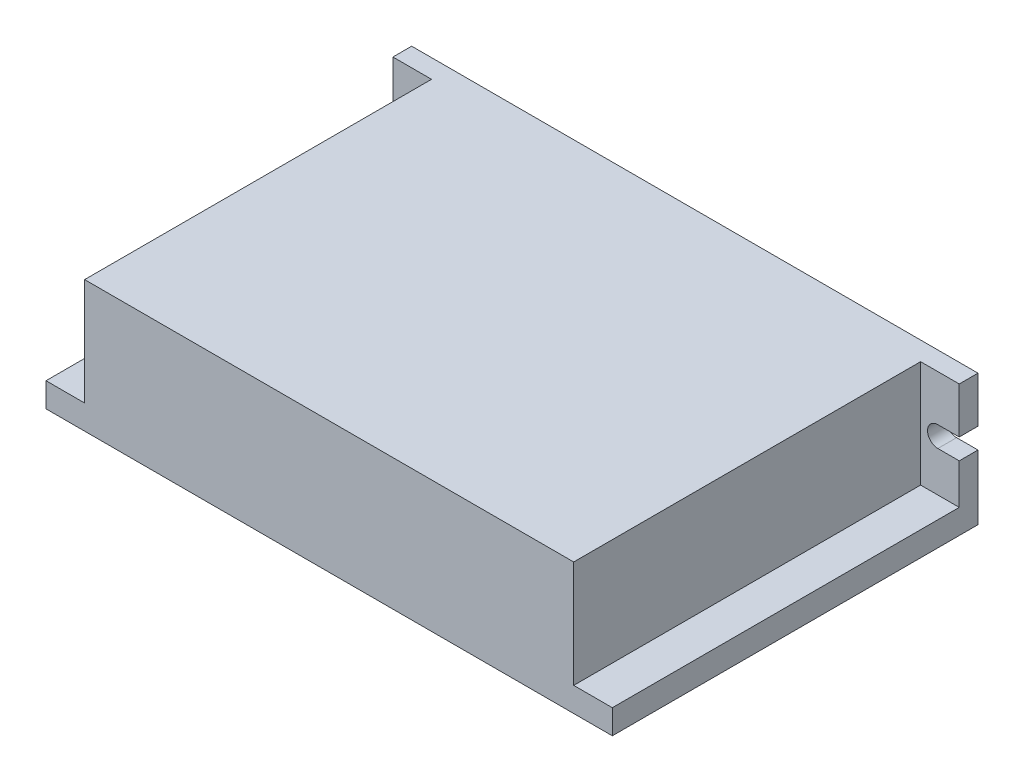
from build123d import *

# Parameters (mm, degrees)
SKETCH_1_W          = 151
SKETCH_1_H          = 97.5
EXTRUDE_1_DEPTH     = 52
SKETCH_2_W          = 10.3
SKETCH_2_H          = 28.5
CUT_EXTRUDE_1_DEPTH = 92.5
CUT_EXTRUDE_2_DEPTH = 5
SKETCH_4_W          = 151
SKETCH_4_H          = 97.5
CUT_EXTRUDE_3_DEPTH = 17


with BuildPart() as part:
    # Sketch 1 → Extrude 1 (new body)
    with BuildSketch(Plane(origin=(0, 0, 0), x_dir=(1, 0, 0), z_dir=(0, 1, 0))):
        with Locations((75.5, 48.75)):
            Rectangle(SKETCH_1_W, SKETCH_1_H)
    extrude(amount=EXTRUDE_1_DEPTH)

    # Sketch 2 → Cut-Extrude 1 (cut)
    with BuildSketch(Plane.XY):
        with Locations((5.15, 37.75)):
            Rectangle(SKETCH_2_W, SKETCH_2_H)
        with Locations((145.85, 37.75)):
            Rectangle(SKETCH_2_W, SKETCH_2_H)
    extrude(amount=-CUT_EXTRUDE_1_DEPTH, mode=Mode.SUBTRACT)

    # Sketch 3 → Cut-Extrude 2 (cut)
    with BuildSketch(Plane.XY.offset(-92.5)):
        with BuildLine():
            Line((145.3, 39.75), (151, 39.75))
            Line((151, 39.75), (151, 34.25))
            Line((151, 34.25), (145.3, 34.25))
            ThreePointArc((145.3, 34.25), (142.55, 37), (145.3, 39.75))
        make_face()
        with BuildLine():
            Line((5.7, 39.75), (0, 39.75))
            Line((0, 39.75), (0, 34.25))
            Line((0, 34.25), (5.7, 34.25))
            ThreePointArc((5.7, 34.25), (8.45, 37), (5.7, 39.75))
        make_face()
    extrude(amount=-CUT_EXTRUDE_2_DEPTH, mode=Mode.SUBTRACT)

    # Sketch 4 → Cut-Extrude 3 (cut)
    with BuildSketch(Plane(origin=(0, 0, 0), x_dir=(1, 0, 0), z_dir=(0, 1, 0))):
        with Locations((75.5, 48.75)):
            Rectangle(SKETCH_4_W, SKETCH_4_H)
    extrude(amount=CUT_EXTRUDE_3_DEPTH, mode=Mode.SUBTRACT)


solid = part.part
